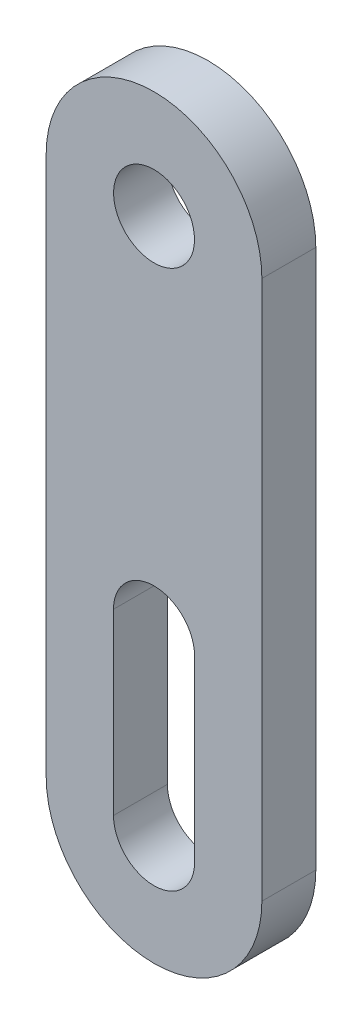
ISO-10303-21;
HEADER;
FILE_DESCRIPTION(('STEP AP214'),'2;1');
FILE_NAME('part.step','',(''),(''),'','','');
FILE_SCHEMA(('AUTOMOTIVE_DESIGN { 1 0 10303 214 1 1 1 1 }'));
ENDSEC;
DATA;
#1=APPLICATION_CONTEXT('core data for automotive mechanical design processes');
#2=APPLICATION_PROTOCOL_DEFINITION('international standard','automotive_design',2000,#1);
#3=PRODUCT_CONTEXT('',#1,'mechanical');
#4=PRODUCT('Part','Part','',(#3));
#5=PRODUCT_RELATED_PRODUCT_CATEGORY('part','',(#4));
#6=PRODUCT_DEFINITION_FORMATION('','',#4);
#7=PRODUCT_DEFINITION_CONTEXT('part definition',#1,'design');
#8=PRODUCT_DEFINITION('design','',#6,#7);
#9=PRODUCT_DEFINITION_SHAPE('','',#8);
#10=(LENGTH_UNIT() NAMED_UNIT(*) SI_UNIT(.MILLI.,.METRE.));
#11=(NAMED_UNIT(*) PLANE_ANGLE_UNIT() SI_UNIT($,.RADIAN.));
#12=(NAMED_UNIT(*) SI_UNIT($,.STERADIAN.) SOLID_ANGLE_UNIT());
#13=UNCERTAINTY_MEASURE_WITH_UNIT(LENGTH_MEASURE(1.E-05),#10,'distance_accuracy_value','');
#14=(GEOMETRIC_REPRESENTATION_CONTEXT(3) GLOBAL_UNCERTAINTY_ASSIGNED_CONTEXT((#13)) GLOBAL_UNIT_ASSIGNED_CONTEXT((#10,
#11,#12)) REPRESENTATION_CONTEXT('',''));
#15=CARTESIAN_POINT('',(0.,0.,0.));
#16=DIRECTION('',(0.,0.,1.));
#17=DIRECTION('',(1.,0.,0.));
#18=AXIS2_PLACEMENT_3D('',#15,#16,#17);
#19=CARTESIAN_POINT('',(6.35,38.1,3.175));
#20=DIRECTION('',(0.,0.,1.));
#21=DIRECTION('',(1.,0.,0.));
#22=AXIS2_PLACEMENT_3D('',#19,#20,#21);
#23=PLANE('',#22);
#24=CARTESIAN_POINT('',(6.35,38.1,3.175));
#25=DIRECTION('',(0.,0.,1.));
#26=DIRECTION('',(1.,0.,0.));
#27=AXIS2_PLACEMENT_3D('',#24,#25,#26);
#28=CIRCLE('',#27,2.38125);
#29=CARTESIAN_POINT('',(8.73125,38.1,3.175));
#30=VERTEX_POINT('',#29);
#31=EDGE_CURVE('E138',#30,#30,#28,.T.);
#32=ORIENTED_EDGE('',*,*,#31,.F.);
#33=EDGE_LOOP('',(#32));
#34=FACE_BOUND('',#33,.T.);
#35=CARTESIAN_POINT('',(6.35,38.1,3.175));
#36=DIRECTION('',(0.,0.,1.));
#37=DIRECTION('',(1.,0.,0.));
#38=AXIS2_PLACEMENT_3D('',#35,#36,#37);
#39=CIRCLE('',#38,6.35);
#40=CARTESIAN_POINT('',(12.7,38.1,3.175));
#41=VERTEX_POINT('',#40);
#42=CARTESIAN_POINT('',(0.,38.1,3.175));
#43=VERTEX_POINT('',#42);
#44=EDGE_CURVE('E153',#41,#43,#39,.T.);
#45=ORIENTED_EDGE('',*,*,#44,.T.);
#46=DIRECTION('',(0.,1.,0.));
#47=VECTOR('',#46,1.);
#48=CARTESIAN_POINT('',(0.,6.35000000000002,3.175));
#49=LINE('',#48,#47);
#50=CARTESIAN_POINT('',(0.,6.35000000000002,3.175));
#51=VERTEX_POINT('',#50);
#52=EDGE_CURVE('E156',#51,#43,#49,.T.);
#53=ORIENTED_EDGE('',*,*,#52,.F.);
#54=CARTESIAN_POINT('',(6.35,6.35000000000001,3.175));
#55=DIRECTION('',(0.,0.,-1.));
#56=DIRECTION('',(-1.,0.,0.));
#57=AXIS2_PLACEMENT_3D('',#54,#55,#56);
#58=CIRCLE('',#57,6.35);
#59=CARTESIAN_POINT('',(12.7,6.35000000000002,3.175));
#60=VERTEX_POINT('',#59);
#61=EDGE_CURVE('E159',#60,#51,#58,.T.);
#62=ORIENTED_EDGE('',*,*,#61,.F.);
#63=DIRECTION('',(0.,-1.,0.));
#64=VECTOR('',#63,1.);
#65=CARTESIAN_POINT('',(12.7,38.1,3.175));
#66=LINE('',#65,#64);
#67=EDGE_CURVE('E162',#41,#60,#66,.T.);
#68=ORIENTED_EDGE('',*,*,#67,.F.);
#69=EDGE_LOOP('',(#45,#53,#62,#68));
#70=FACE_BOUND('',#69,.T.);
#71=DIRECTION('',(0.,1.,0.));
#72=VECTOR('',#71,1.);
#73=CARTESIAN_POINT('',(8.73760000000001,6.35000000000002,3.175));
#74=LINE('',#73,#72);
#75=CARTESIAN_POINT('',(8.73760000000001,6.35000000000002,3.175));
#76=VERTEX_POINT('',#75);
#77=CARTESIAN_POINT('',(8.73760000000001,16.8656,3.175));
#78=VERTEX_POINT('',#77);
#79=EDGE_CURVE('E125',#76,#78,#74,.T.);
#80=ORIENTED_EDGE('',*,*,#79,.F.);
#81=CARTESIAN_POINT('',(6.35,6.35000000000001,3.175));
#82=DIRECTION('',(0.,0.,1.));
#83=DIRECTION('',(1.,0.,0.));
#84=AXIS2_PLACEMENT_3D('',#81,#82,#83);
#85=CIRCLE('',#84,2.3876);
#86=CARTESIAN_POINT('',(3.96240000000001,6.35000000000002,3.175));
#87=VERTEX_POINT('',#86);
#88=EDGE_CURVE('E101',#87,#76,#85,.T.);
#89=ORIENTED_EDGE('',*,*,#88,.F.);
#90=DIRECTION('',(0.,1.,0.));
#91=VECTOR('',#90,1.);
#92=CARTESIAN_POINT('',(3.96240000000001,6.35000000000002,3.175));
#93=LINE('',#92,#91);
#94=CARTESIAN_POINT('',(3.9624,16.8656,3.175));
#95=VERTEX_POINT('',#94);
#96=EDGE_CURVE('E128',#87,#95,#93,.T.);
#97=ORIENTED_EDGE('',*,*,#96,.T.);
#98=CARTESIAN_POINT('',(6.35,16.8656,3.175));
#99=DIRECTION('',(0.,0.,-1.));
#100=DIRECTION('',(-1.,0.,0.));
#101=AXIS2_PLACEMENT_3D('',#98,#99,#100);
#102=CIRCLE('',#101,2.3876);
#103=EDGE_CURVE('E50',#95,#78,#102,.T.);
#104=ORIENTED_EDGE('',*,*,#103,.T.);
#105=EDGE_LOOP('',(#80,#89,#97,#104));
#106=FACE_BOUND('',#105,.T.);
#107=ADVANCED_FACE('F35',(#34,#70,#106),#23,.T.);
#108=CARTESIAN_POINT('',(6.35,38.1,0.));
#109=DIRECTION('',(0.,0.,1.));
#110=DIRECTION('',(1.,0.,0.));
#111=AXIS2_PLACEMENT_3D('',#108,#109,#110);
#112=PLANE('',#111);
#113=CARTESIAN_POINT('',(6.35,38.1,0.));
#114=DIRECTION('',(0.,0.,1.));
#115=DIRECTION('',(1.,0.,0.));
#116=AXIS2_PLACEMENT_3D('',#113,#114,#115);
#117=CIRCLE('',#116,2.38125);
#118=CARTESIAN_POINT('',(8.73125,38.1,0.));
#119=VERTEX_POINT('',#118);
#120=EDGE_CURVE('E105',#119,#119,#117,.T.);
#121=ORIENTED_EDGE('',*,*,#120,.T.);
#122=EDGE_LOOP('',(#121));
#123=FACE_BOUND('',#122,.T.);
#124=CARTESIAN_POINT('',(6.35,38.1,0.));
#125=DIRECTION('',(0.,0.,1.));
#126=DIRECTION('',(1.,0.,0.));
#127=AXIS2_PLACEMENT_3D('',#124,#125,#126);
#128=CIRCLE('',#127,6.35);
#129=CARTESIAN_POINT('',(12.7,38.1,0.));
#130=VERTEX_POINT('',#129);
#131=CARTESIAN_POINT('',(0.,38.1,0.));
#132=VERTEX_POINT('',#131);
#133=EDGE_CURVE('E141',#130,#132,#128,.T.);
#134=ORIENTED_EDGE('',*,*,#133,.F.);
#135=DIRECTION('',(0.,-1.,0.));
#136=VECTOR('',#135,1.);
#137=CARTESIAN_POINT('',(12.7,38.1,0.));
#138=LINE('',#137,#136);
#139=CARTESIAN_POINT('',(12.7,6.35000000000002,0.));
#140=VERTEX_POINT('',#139);
#141=EDGE_CURVE('E150',#130,#140,#138,.T.);
#142=ORIENTED_EDGE('',*,*,#141,.T.);
#143=CARTESIAN_POINT('',(6.35,6.35000000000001,0.));
#144=DIRECTION('',(0.,0.,-1.));
#145=DIRECTION('',(-1.,0.,0.));
#146=AXIS2_PLACEMENT_3D('',#143,#144,#145);
#147=CIRCLE('',#146,6.35);
#148=CARTESIAN_POINT('',(0.,6.35000000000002,0.));
#149=VERTEX_POINT('',#148);
#150=EDGE_CURVE('E147',#140,#149,#147,.T.);
#151=ORIENTED_EDGE('',*,*,#150,.T.);
#152=DIRECTION('',(0.,1.,0.));
#153=VECTOR('',#152,1.);
#154=CARTESIAN_POINT('',(0.,6.35000000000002,0.));
#155=LINE('',#154,#153);
#156=EDGE_CURVE('E144',#149,#132,#155,.T.);
#157=ORIENTED_EDGE('',*,*,#156,.T.);
#158=EDGE_LOOP('',(#134,#142,#151,#157));
#159=FACE_BOUND('',#158,.T.);
#160=CARTESIAN_POINT('',(6.35,6.35000000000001,0.));
#161=DIRECTION('',(0.,0.,1.));
#162=DIRECTION('',(1.,0.,0.));
#163=AXIS2_PLACEMENT_3D('',#160,#161,#162);
#164=CIRCLE('',#163,2.3876);
#165=CARTESIAN_POINT('',(3.96240000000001,6.35000000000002,0.));
#166=VERTEX_POINT('',#165);
#167=CARTESIAN_POINT('',(8.73760000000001,6.35000000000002,0.));
#168=VERTEX_POINT('',#167);
#169=EDGE_CURVE('E58',#166,#168,#164,.T.);
#170=ORIENTED_EDGE('',*,*,#169,.T.);
#171=DIRECTION('',(0.,1.,0.));
#172=VECTOR('',#171,1.);
#173=CARTESIAN_POINT('',(8.73760000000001,6.35000000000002,0.));
#174=LINE('',#173,#172);
#175=CARTESIAN_POINT('',(8.73760000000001,16.8656,0.));
#176=VERTEX_POINT('',#175);
#177=EDGE_CURVE('E109',#168,#176,#174,.T.);
#178=ORIENTED_EDGE('',*,*,#177,.T.);
#179=CARTESIAN_POINT('',(6.35,16.8656,0.));
#180=DIRECTION('',(0.,0.,-1.));
#181=DIRECTION('',(-1.,0.,0.));
#182=AXIS2_PLACEMENT_3D('',#179,#180,#181);
#183=CIRCLE('',#182,2.3876);
#184=CARTESIAN_POINT('',(3.9624,16.8656,0.));
#185=VERTEX_POINT('',#184);
#186=EDGE_CURVE('E114',#185,#176,#183,.T.);
#187=ORIENTED_EDGE('',*,*,#186,.F.);
#188=DIRECTION('',(0.,1.,0.));
#189=VECTOR('',#188,1.);
#190=CARTESIAN_POINT('',(3.96240000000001,6.35000000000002,0.));
#191=LINE('',#190,#189);
#192=EDGE_CURVE('E119',#166,#185,#191,.T.);
#193=ORIENTED_EDGE('',*,*,#192,.F.);
#194=EDGE_LOOP('',(#170,#178,#187,#193));
#195=FACE_BOUND('',#194,.T.);
#196=ADVANCED_FACE('F117',(#123,#159,#195),#112,.F.);
#197=CARTESIAN_POINT('',(6.35,38.1,3.175));
#198=DIRECTION('',(0.,0.,-1.));
#199=DIRECTION('',(-1.,0.,0.));
#200=AXIS2_PLACEMENT_3D('',#197,#198,#199);
#201=CYLINDRICAL_SURFACE('',#200,6.35);
#202=DIRECTION('',(0.,0.,-1.));
#203=VECTOR('',#202,1.);
#204=CARTESIAN_POINT('',(0.,38.1,3.175));
#205=LINE('',#204,#203);
#206=EDGE_CURVE('E11',#43,#132,#205,.T.);
#207=ORIENTED_EDGE('',*,*,#206,.F.);
#208=ORIENTED_EDGE('',*,*,#44,.F.);
#209=DIRECTION('',(0.,0.,-1.));
#210=VECTOR('',#209,1.);
#211=CARTESIAN_POINT('',(12.7,38.1,3.175));
#212=LINE('',#211,#210);
#213=EDGE_CURVE('E165',#41,#130,#212,.T.);
#214=ORIENTED_EDGE('',*,*,#213,.T.);
#215=ORIENTED_EDGE('',*,*,#133,.T.);
#216=EDGE_LOOP('',(#207,#208,#214,#215));
#217=FACE_BOUND('',#216,.T.);
#218=ADVANCED_FACE('F185',(#217),#201,.T.);
#219=CARTESIAN_POINT('',(0.,6.35000000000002,3.175));
#220=DIRECTION('',(-1.,0.,0.));
#221=DIRECTION('',(0.,0.,1.));
#222=AXIS2_PLACEMENT_3D('',#219,#220,#221);
#223=PLANE('',#222);
#224=DIRECTION('',(0.,0.,-1.));
#225=VECTOR('',#224,1.);
#226=CARTESIAN_POINT('',(0.,6.35000000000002,3.175));
#227=LINE('',#226,#225);
#228=EDGE_CURVE('E43',#51,#149,#227,.T.);
#229=ORIENTED_EDGE('',*,*,#228,.F.);
#230=ORIENTED_EDGE('',*,*,#52,.T.);
#231=ORIENTED_EDGE('',*,*,#206,.T.);
#232=ORIENTED_EDGE('',*,*,#156,.F.);
#233=EDGE_LOOP('',(#229,#230,#231,#232));
#234=FACE_BOUND('',#233,.T.);
#235=ADVANCED_FACE('F37',(#234),#223,.T.);
#236=CARTESIAN_POINT('',(6.35,6.35000000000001,3.175));
#237=DIRECTION('',(0.,0.,-1.));
#238=DIRECTION('',(-1.,0.,0.));
#239=AXIS2_PLACEMENT_3D('',#236,#237,#238);
#240=CYLINDRICAL_SURFACE('',#239,6.35);
#241=DIRECTION('',(0.,0.,-1.));
#242=VECTOR('',#241,1.);
#243=CARTESIAN_POINT('',(12.7,6.35000000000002,3.175));
#244=LINE('',#243,#242);
#245=EDGE_CURVE('E167',#60,#140,#244,.T.);
#246=ORIENTED_EDGE('',*,*,#245,.F.);
#247=ORIENTED_EDGE('',*,*,#61,.T.);
#248=ORIENTED_EDGE('',*,*,#228,.T.);
#249=ORIENTED_EDGE('',*,*,#150,.F.);
#250=EDGE_LOOP('',(#246,#247,#248,#249));
#251=FACE_BOUND('',#250,.T.);
#252=ADVANCED_FACE('F171',(#251),#240,.T.);
#253=CARTESIAN_POINT('',(12.7,38.1,3.175));
#254=DIRECTION('',(1.,0.,0.));
#255=DIRECTION('',(0.,1.,0.));
#256=AXIS2_PLACEMENT_3D('',#253,#254,#255);
#257=PLANE('',#256);
#258=ORIENTED_EDGE('',*,*,#67,.T.);
#259=ORIENTED_EDGE('',*,*,#245,.T.);
#260=ORIENTED_EDGE('',*,*,#141,.F.);
#261=ORIENTED_EDGE('',*,*,#213,.F.);
#262=EDGE_LOOP('',(#258,#259,#260,#261));
#263=FACE_BOUND('',#262,.T.);
#264=ADVANCED_FACE('F179',(#263),#257,.T.);
#265=CARTESIAN_POINT('',(6.35,38.1,3.175));
#266=DIRECTION('',(0.,0.,-1.));
#267=DIRECTION('',(-1.,0.,0.));
#268=AXIS2_PLACEMENT_3D('',#265,#266,#267);
#269=CYLINDRICAL_SURFACE('',#268,2.38125);
#270=ORIENTED_EDGE('',*,*,#31,.T.);
#271=EDGE_LOOP('',(#270));
#272=FACE_BOUND('',#271,.T.);
#273=ORIENTED_EDGE('',*,*,#120,.F.);
#274=EDGE_LOOP('',(#273));
#275=FACE_BOUND('',#274,.T.);
#276=ADVANCED_FACE('F202',(#272,#275),#269,.F.);
#277=CARTESIAN_POINT('',(6.35,6.35000000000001,3.175));
#278=DIRECTION('',(0.,0.,-1.));
#279=DIRECTION('',(-1.,0.,0.));
#280=AXIS2_PLACEMENT_3D('',#277,#278,#279);
#281=CYLINDRICAL_SURFACE('',#280,2.3876);
#282=DIRECTION('',(0.,0.,-1.));
#283=VECTOR('',#282,1.);
#284=CARTESIAN_POINT('',(8.73760000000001,6.35000000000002,3.175));
#285=LINE('',#284,#283);
#286=EDGE_CURVE('E97',#76,#168,#285,.T.);
#287=ORIENTED_EDGE('',*,*,#286,.T.);
#288=ORIENTED_EDGE('',*,*,#169,.F.);
#289=DIRECTION('',(0.,0.,-1.));
#290=VECTOR('',#289,1.);
#291=CARTESIAN_POINT('',(3.96240000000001,6.35000000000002,3.175));
#292=LINE('',#291,#290);
#293=EDGE_CURVE('E131',#87,#166,#292,.T.);
#294=ORIENTED_EDGE('',*,*,#293,.F.);
#295=ORIENTED_EDGE('',*,*,#88,.T.);
#296=EDGE_LOOP('',(#287,#288,#294,#295));
#297=FACE_BOUND('',#296,.T.);
#298=ADVANCED_FACE('F99',(#297),#281,.F.);
#299=CARTESIAN_POINT('',(8.73760000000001,6.35000000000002,3.175));
#300=DIRECTION('',(-1.,0.,0.));
#301=DIRECTION('',(0.,0.,1.));
#302=AXIS2_PLACEMENT_3D('',#299,#300,#301);
#303=PLANE('',#302);
#304=DIRECTION('',(0.,0.,-1.));
#305=VECTOR('',#304,1.);
#306=CARTESIAN_POINT('',(8.73760000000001,16.8656,3.175));
#307=LINE('',#306,#305);
#308=EDGE_CURVE('E106',#78,#176,#307,.T.);
#309=ORIENTED_EDGE('',*,*,#308,.T.);
#310=ORIENTED_EDGE('',*,*,#177,.F.);
#311=ORIENTED_EDGE('',*,*,#286,.F.);
#312=ORIENTED_EDGE('',*,*,#79,.T.);
#313=EDGE_LOOP('',(#309,#310,#311,#312));
#314=FACE_BOUND('',#313,.T.);
#315=ADVANCED_FACE('F110',(#314),#303,.T.);
#316=CARTESIAN_POINT('',(6.35,16.8656,3.175));
#317=DIRECTION('',(0.,0.,-1.));
#318=DIRECTION('',(-1.,0.,0.));
#319=AXIS2_PLACEMENT_3D('',#316,#317,#318);
#320=CYLINDRICAL_SURFACE('',#319,2.3876);
#321=DIRECTION('',(0.,0.,-1.));
#322=VECTOR('',#321,1.);
#323=CARTESIAN_POINT('',(3.9624,16.8656,3.175));
#324=LINE('',#323,#322);
#325=EDGE_CURVE('E133',#95,#185,#324,.T.);
#326=ORIENTED_EDGE('',*,*,#325,.T.);
#327=ORIENTED_EDGE('',*,*,#186,.T.);
#328=ORIENTED_EDGE('',*,*,#308,.F.);
#329=ORIENTED_EDGE('',*,*,#103,.F.);
#330=EDGE_LOOP('',(#326,#327,#328,#329));
#331=FACE_BOUND('',#330,.T.);
#332=ADVANCED_FACE('F208',(#331),#320,.F.);
#333=CARTESIAN_POINT('',(3.96240000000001,6.35000000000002,3.175));
#334=DIRECTION('',(-1.,0.,0.));
#335=DIRECTION('',(0.,0.,1.));
#336=AXIS2_PLACEMENT_3D('',#333,#334,#335);
#337=PLANE('',#336);
#338=ORIENTED_EDGE('',*,*,#96,.F.);
#339=ORIENTED_EDGE('',*,*,#293,.T.);
#340=ORIENTED_EDGE('',*,*,#192,.T.);
#341=ORIENTED_EDGE('',*,*,#325,.F.);
#342=EDGE_LOOP('',(#338,#339,#340,#341));
#343=FACE_BOUND('',#342,.T.);
#344=ADVANCED_FACE('F211',(#343),#337,.F.);
#345=CLOSED_SHELL('',(#107,#196,#218,#235,#252,#264,#276,#298,#315,#332,#344));
#346=MANIFOLD_SOLID_BREP('B2',#345);
#347=ADVANCED_BREP_SHAPE_REPRESENTATION('',(#18,#346),#14);
#348=SHAPE_DEFINITION_REPRESENTATION(#9,#347);
ENDSEC;
END-ISO-10303-21;
